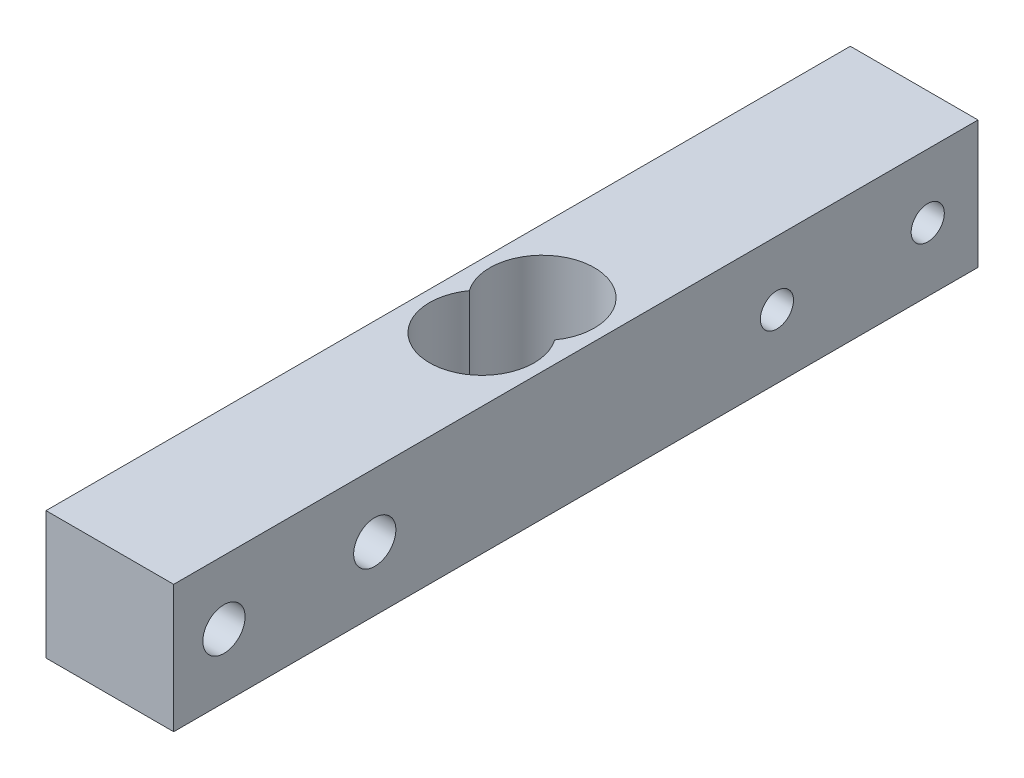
from build123d import *

# Parameters (mm, degrees)
ESQUISSE1_W             = 12.7
ESQUISSE1_H             = 12.7
BOSS_EXTRU_1_DEPTH      = 80
ENL_V_MAT_EXTRU_2_REACH = 83.991
TROU_TARAUD_M5X0_86_D   = 4.2
TROU_TARAUD_M4X0_71_D   = 3.3


with BuildPart() as part:
    # Esquisse1 → Boss.-Extru.1 (new body)
    with BuildSketch(Plane.XY):
        with Locations((6.35, 6.35)):
            Rectangle(ESQUISSE1_W, ESQUISSE1_H)
    extrude(amount=BOSS_EXTRU_1_DEPTH)

    # Esquisse7 → Enl_v. mat.-Extru.2 (cut, up to next)
    with BuildSketch(Plane.XZ, mode=Mode.PRIVATE) as enl_v_mat_extru_2_sk1:
        with BuildLine():
            ThreePointArc((10.597352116, 40), (6.35, 48.2), (2.102647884, 40))
            ThreePointArc((2.102647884, 40), (6.35, 31.8), (10.597352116, 40))
        make_face()
    enl_v_mat_extru_2_tool1 = extrude(enl_v_mat_extru_2_sk1.sketch, amount=-ENL_V_MAT_EXTRU_2_REACH, mode=Mode.PRIVATE) & part.part
    add(enl_v_mat_extru_2_tool1.solids().sort_by_distance((6.35, 0, 40))[0], mode=Mode.SUBTRACT)

    # Trou taraud_ M5x0.86 (through all)
    with Locations(Plane(origin=(12.7, 0, 0), x_dir=(0, 0, -1), z_dir=(1, 0, 0))):
        with Locations((-75, 6.35), (-60, 6.35)):
            Hole(TROU_TARAUD_M5X0_86_D / 2)

    # Trou taraud_ M4x0.71 (through all)
    with Locations(Plane(origin=(12.7, 0, 0), x_dir=(0, 0, -1), z_dir=(1, 0, 0))):
        with Locations((-20, 6.35), (-5, 6.35)):
            Hole(TROU_TARAUD_M4X0_71_D / 2)


solid = part.part
